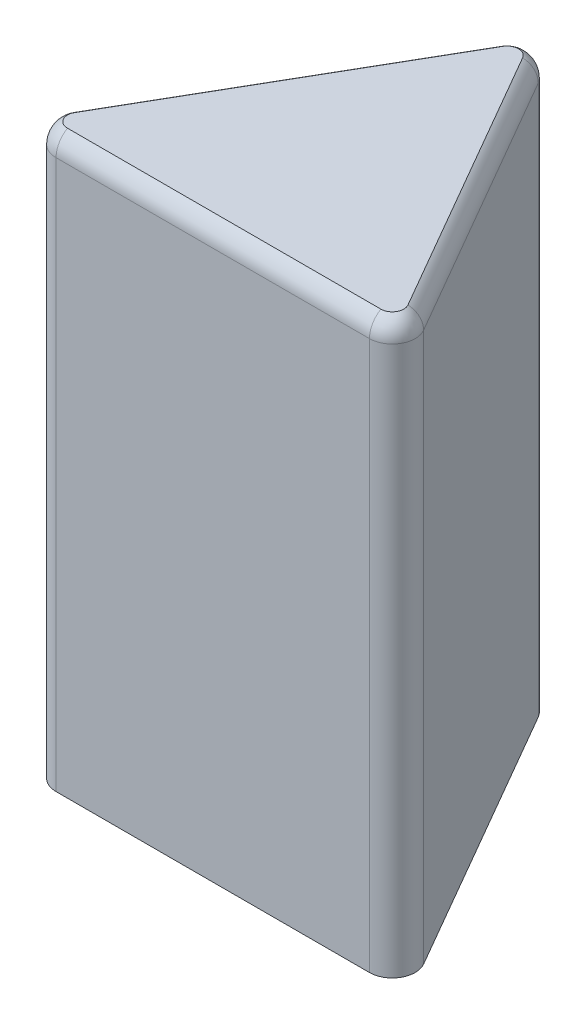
ISO-10303-21;
HEADER;
FILE_DESCRIPTION(('STEP AP214'),'2;1');
FILE_NAME('part.step','',(''),(''),'','','');
FILE_SCHEMA(('AUTOMOTIVE_DESIGN { 1 0 10303 214 1 1 1 1 }'));
ENDSEC;
DATA;
#1=APPLICATION_CONTEXT('core data for automotive mechanical design processes');
#2=APPLICATION_PROTOCOL_DEFINITION('international standard','automotive_design',2000,#1);
#3=PRODUCT_CONTEXT('',#1,'mechanical');
#4=PRODUCT('Part','Part','',(#3));
#5=PRODUCT_RELATED_PRODUCT_CATEGORY('part','',(#4));
#6=PRODUCT_DEFINITION_FORMATION('','',#4);
#7=PRODUCT_DEFINITION_CONTEXT('part definition',#1,'design');
#8=PRODUCT_DEFINITION('design','',#6,#7);
#9=PRODUCT_DEFINITION_SHAPE('','',#8);
#10=(LENGTH_UNIT() NAMED_UNIT(*) SI_UNIT(.MILLI.,.METRE.));
#11=(NAMED_UNIT(*) PLANE_ANGLE_UNIT() SI_UNIT($,.RADIAN.));
#12=(NAMED_UNIT(*) SI_UNIT($,.STERADIAN.) SOLID_ANGLE_UNIT());
#13=UNCERTAINTY_MEASURE_WITH_UNIT(LENGTH_MEASURE(1.E-05),#10,'distance_accuracy_value','');
#14=(GEOMETRIC_REPRESENTATION_CONTEXT(3) GLOBAL_UNCERTAINTY_ASSIGNED_CONTEXT((#13)) GLOBAL_UNIT_ASSIGNED_CONTEXT((#10,
#11,#12)) REPRESENTATION_CONTEXT('',''));
#15=CARTESIAN_POINT('',(0.,0.,0.));
#16=DIRECTION('',(0.,0.,1.));
#17=DIRECTION('',(1.,0.,0.));
#18=AXIS2_PLACEMENT_3D('',#15,#16,#17);
#19=CARTESIAN_POINT('',(0.,25.,0.));
#20=DIRECTION('',(0.,-1.,0.));
#21=DIRECTION('',(0.,0.,-1.));
#22=AXIS2_PLACEMENT_3D('',#19,#20,#21);
#23=CYLINDRICAL_SURFACE('',#22,4.05);
#24=DIRECTION('',(0.,-1.,0.));
#25=VECTOR('',#24,1.);
#26=CARTESIAN_POINT('',(-1.55,25.,-3.74165738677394));
#27=LINE('',#26,#25);
#28=CARTESIAN_POINT('',(-1.55,22.,-3.74165738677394));
#29=VERTEX_POINT('',#28);
#30=CARTESIAN_POINT('',(-1.55,0.5,-3.74165738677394));
#31=VERTEX_POINT('',#30);
#32=EDGE_CURVE('E181',#29,#31,#27,.T.);
#33=ORIENTED_EDGE('',*,*,#32,.F.);
#34=CARTESIAN_POINT('',(0.,22.,0.));
#35=DIRECTION('',(0.,1.,0.));
#36=DIRECTION('',(0.,0.,1.));
#37=AXIS2_PLACEMENT_3D('',#34,#35,#36);
#38=CIRCLE('',#37,4.05);
#39=CARTESIAN_POINT('',(1.55,22.,-3.74165738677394));
#40=VERTEX_POINT('',#39);
#41=EDGE_CURVE('E54',#29,#40,#38,.T.);
#42=ORIENTED_EDGE('',*,*,#41,.T.);
#43=DIRECTION('',(0.,-1.,0.));
#44=VECTOR('',#43,1.);
#45=CARTESIAN_POINT('',(1.55,25.,-3.74165738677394));
#46=LINE('',#45,#44);
#47=CARTESIAN_POINT('',(1.55,0.5,-3.74165738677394));
#48=VERTEX_POINT('',#47);
#49=EDGE_CURVE('E188',#40,#48,#46,.T.);
#50=ORIENTED_EDGE('',*,*,#49,.T.);
#51=CARTESIAN_POINT('',(0.,0.5,0.));
#52=DIRECTION('',(0.,1.,0.));
#53=DIRECTION('',(0.,0.,1.));
#54=AXIS2_PLACEMENT_3D('',#51,#52,#53);
#55=CIRCLE('',#54,4.05);
#56=EDGE_CURVE('E238',#48,#31,#55,.F.);
#57=ORIENTED_EDGE('',*,*,#56,.T.);
#58=EDGE_LOOP('',(#33,#42,#50,#57));
#59=FACE_BOUND('',#58,.T.);
#60=ADVANCED_FACE('F39',(#59),#23,.F.);
#61=CARTESIAN_POINT('',(1.55,25.,-5.15));
#62=DIRECTION('',(-1.,0.,0.));
#63=DIRECTION('',(0.,0.,1.));
#64=AXIS2_PLACEMENT_3D('',#61,#62,#63);
#65=PLANE('',#64);
#66=ORIENTED_EDGE('',*,*,#49,.F.);
#67=DIRECTION('',(0.,0.,-1.));
#68=VECTOR('',#67,1.);
#69=CARTESIAN_POINT('',(1.55,22.,-5.15));
#70=LINE('',#69,#68);
#71=CARTESIAN_POINT('',(1.55,22.,-5.15));
#72=VERTEX_POINT('',#71);
#73=EDGE_CURVE('E177',#40,#72,#70,.T.);
#74=ORIENTED_EDGE('',*,*,#73,.T.);
#75=DIRECTION('',(0.,-1.,0.));
#76=VECTOR('',#75,1.);
#77=CARTESIAN_POINT('',(1.55,25.,-5.15));
#78=LINE('',#77,#76);
#79=CARTESIAN_POINT('',(1.55,0.5,-5.15));
#80=VERTEX_POINT('',#79);
#81=EDGE_CURVE('E186',#72,#80,#78,.T.);
#82=ORIENTED_EDGE('',*,*,#81,.T.);
#83=DIRECTION('',(0.,0.,1.));
#84=VECTOR('',#83,1.);
#85=CARTESIAN_POINT('',(1.55,0.5,-3.74165738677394));
#86=LINE('',#85,#84);
#87=EDGE_CURVE('E229',#80,#48,#86,.T.);
#88=ORIENTED_EDGE('',*,*,#87,.T.);
#89=EDGE_LOOP('',(#66,#74,#82,#88));
#90=FACE_BOUND('',#89,.T.);
#91=ADVANCED_FACE('F359',(#90),#65,.T.);
#92=CARTESIAN_POINT('',(-1.55,25.,-5.15));
#93=DIRECTION('',(0.,0.,1.));
#94=DIRECTION('',(1.,0.,0.));
#95=AXIS2_PLACEMENT_3D('',#92,#93,#94);
#96=PLANE('',#95);
#97=ORIENTED_EDGE('',*,*,#81,.F.);
#98=DIRECTION('',(-1.,0.,0.));
#99=VECTOR('',#98,1.);
#100=CARTESIAN_POINT('',(-1.55,22.,-5.15));
#101=LINE('',#100,#99);
#102=CARTESIAN_POINT('',(-1.55,22.,-5.15));
#103=VERTEX_POINT('',#102);
#104=EDGE_CURVE('E174',#72,#103,#101,.T.);
#105=ORIENTED_EDGE('',*,*,#104,.T.);
#106=DIRECTION('',(0.,-1.,0.));
#107=VECTOR('',#106,1.);
#108=CARTESIAN_POINT('',(-1.55,25.,-5.15));
#109=LINE('',#108,#107);
#110=CARTESIAN_POINT('',(-1.55,0.5,-5.15));
#111=VERTEX_POINT('',#110);
#112=EDGE_CURVE('E183',#103,#111,#109,.T.);
#113=ORIENTED_EDGE('',*,*,#112,.T.);
#114=DIRECTION('',(1.,0.,0.));
#115=VECTOR('',#114,1.);
#116=CARTESIAN_POINT('',(1.55,0.500000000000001,-5.15));
#117=LINE('',#116,#115);
#118=EDGE_CURVE('E232',#111,#80,#117,.T.);
#119=ORIENTED_EDGE('',*,*,#118,.T.);
#120=EDGE_LOOP('',(#97,#105,#113,#119));
#121=FACE_BOUND('',#120,.T.);
#122=ADVANCED_FACE('F365',(#121),#96,.T.);
#123=CARTESIAN_POINT('',(-1.55,25.,-3.74165738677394));
#124=DIRECTION('',(1.,0.,0.));
#125=DIRECTION('',(0.,0.,-1.));
#126=AXIS2_PLACEMENT_3D('',#123,#124,#125);
#127=PLANE('',#126);
#128=ORIENTED_EDGE('',*,*,#112,.F.);
#129=DIRECTION('',(0.,0.,1.));
#130=VECTOR('',#129,1.);
#131=CARTESIAN_POINT('',(-1.55,22.,-3.74165738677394));
#132=LINE('',#131,#130);
#133=EDGE_CURVE('E11',#103,#29,#132,.T.);
#134=ORIENTED_EDGE('',*,*,#133,.T.);
#135=ORIENTED_EDGE('',*,*,#32,.T.);
#136=DIRECTION('',(0.,0.,-1.));
#137=VECTOR('',#136,1.);
#138=CARTESIAN_POINT('',(-1.55,0.500000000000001,-5.15));
#139=LINE('',#138,#137);
#140=EDGE_CURVE('E235',#31,#111,#139,.T.);
#141=ORIENTED_EDGE('',*,*,#140,.T.);
#142=EDGE_LOOP('',(#128,#134,#135,#141));
#143=FACE_BOUND('',#142,.T.);
#144=ADVANCED_FACE('F355',(#143),#127,.T.);
#145=CARTESIAN_POINT('',(-6.85,0.,3.95484934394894));
#146=DIRECTION('',(0.,1.,0.));
#147=DIRECTION('',(0.,0.,1.));
#148=AXIS2_PLACEMENT_3D('',#145,#146,#147);
#149=PLANE('',#148);
#150=CARTESIAN_POINT('',(0.,0.,0.));
#151=DIRECTION('',(0.,1.,0.));
#152=DIRECTION('',(0.,0.,1.));
#153=AXIS2_PLACEMENT_3D('',#150,#151,#152);
#154=CIRCLE('',#153,4.55);
#155=CARTESIAN_POINT('',(-2.04999999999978,0.,-4.06201920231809));
#156=VERTEX_POINT('',#155);
#157=CARTESIAN_POINT('',(2.04999999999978,0.,-4.06201920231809));
#158=VERTEX_POINT('',#157);
#159=EDGE_CURVE('E220',#156,#158,#154,.T.);
#160=ORIENTED_EDGE('',*,*,#159,.T.);
#161=DIRECTION('',(0.,0.,-1.));
#162=VECTOR('',#161,1.);
#163=CARTESIAN_POINT('',(2.05,0.,-5.15));
#164=LINE('',#163,#162);
#165=CARTESIAN_POINT('',(2.05,0.,-5.65));
#166=VERTEX_POINT('',#165);
#167=EDGE_CURVE('E226',#158,#166,#164,.T.);
#168=ORIENTED_EDGE('',*,*,#167,.T.);
#169=DIRECTION('',(-1.,0.,0.));
#170=VECTOR('',#169,1.);
#171=CARTESIAN_POINT('',(-1.55,0.,-5.65));
#172=LINE('',#171,#170);
#173=CARTESIAN_POINT('',(-2.05,0.,-5.65));
#174=VERTEX_POINT('',#173);
#175=EDGE_CURVE('E224',#166,#174,#172,.T.);
#176=ORIENTED_EDGE('',*,*,#175,.T.);
#177=DIRECTION('',(0.,0.,1.));
#178=VECTOR('',#177,1.);
#179=CARTESIAN_POINT('',(-2.05,0.,-3.74165738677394));
#180=LINE('',#179,#178);
#181=EDGE_CURVE('E222',#174,#156,#180,.T.);
#182=ORIENTED_EDGE('',*,*,#181,.T.);
#183=EDGE_LOOP('',(#160,#168,#176,#182));
#184=FACE_BOUND('',#183,.T.);
#185=CARTESIAN_POINT('',(-6.85,0.,3.95484934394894));
#186=DIRECTION('',(0.,1.,0.));
#187=DIRECTION('',(0.,0.,1.));
#188=AXIS2_PLACEMENT_3D('',#185,#186,#187);
#189=CIRCLE('',#188,1.);
#190=CARTESIAN_POINT('',(-7.71602540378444,0.,3.45484934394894));
#191=VERTEX_POINT('',#190);
#192=CARTESIAN_POINT('',(-6.85,0.,4.95484934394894));
#193=VERTEX_POINT('',#192);
#194=EDGE_CURVE('E190',#191,#193,#189,.T.);
#195=ORIENTED_EDGE('',*,*,#194,.F.);
#196=DIRECTION('',(-0.5,0.,0.866025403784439));
#197=VECTOR('',#196,1.);
#198=CARTESIAN_POINT('',(-0.866025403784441,0.,-8.40969868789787));
#199=LINE('',#198,#197);
#200=CARTESIAN_POINT('',(-0.866025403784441,0.,-8.40969868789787));
#201=VERTEX_POINT('',#200);
#202=EDGE_CURVE('E205',#201,#191,#199,.T.);
#203=ORIENTED_EDGE('',*,*,#202,.F.);
#204=CARTESIAN_POINT('',(0.,0.,-7.90969868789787));
#205=DIRECTION('',(0.,1.,0.));
#206=DIRECTION('',(0.,0.,1.));
#207=AXIS2_PLACEMENT_3D('',#204,#205,#206);
#208=CIRCLE('',#207,1.);
#209=CARTESIAN_POINT('',(0.866025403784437,0.,-8.40969868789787));
#210=VERTEX_POINT('',#209);
#211=EDGE_CURVE('E202',#210,#201,#208,.T.);
#212=ORIENTED_EDGE('',*,*,#211,.F.);
#213=DIRECTION('',(-0.5,0.,-0.866025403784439));
#214=VECTOR('',#213,1.);
#215=CARTESIAN_POINT('',(0.866025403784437,0.,-8.40969868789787));
#216=LINE('',#215,#214);
#217=CARTESIAN_POINT('',(7.71602540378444,0.,3.45484934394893));
#218=VERTEX_POINT('',#217);
#219=EDGE_CURVE('E199',#218,#210,#216,.T.);
#220=ORIENTED_EDGE('',*,*,#219,.F.);
#221=CARTESIAN_POINT('',(6.85,0.,3.95484934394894));
#222=DIRECTION('',(0.,1.,0.));
#223=DIRECTION('',(0.,0.,1.));
#224=AXIS2_PLACEMENT_3D('',#221,#222,#223);
#225=CIRCLE('',#224,0.999999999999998);
#226=CARTESIAN_POINT('',(6.85,0.,4.95484934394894));
#227=VERTEX_POINT('',#226);
#228=EDGE_CURVE('E196',#227,#218,#225,.T.);
#229=ORIENTED_EDGE('',*,*,#228,.F.);
#230=DIRECTION('',(1.,0.,0.));
#231=VECTOR('',#230,1.);
#232=CARTESIAN_POINT('',(-6.85,0.,4.95484934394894));
#233=LINE('',#232,#231);
#234=EDGE_CURVE('E193',#193,#227,#233,.T.);
#235=ORIENTED_EDGE('',*,*,#234,.F.);
#236=EDGE_LOOP('',(#195,#203,#212,#220,#229,#235));
#237=FACE_BOUND('',#236,.T.);
#238=ADVANCED_FACE('F340',(#184,#237),#149,.F.);
#239=CARTESIAN_POINT('',(-6.85,25.,3.95484934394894));
#240=DIRECTION('',(0.,-1.,0.));
#241=DIRECTION('',(0.,0.,-1.));
#242=AXIS2_PLACEMENT_3D('',#239,#240,#241);
#243=CYLINDRICAL_SURFACE('',#242,1.);
#244=DIRECTION('',(0.,-1.,0.));
#245=VECTOR('',#244,1.);
#246=CARTESIAN_POINT('',(-6.85,25.,4.95484934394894));
#247=LINE('',#246,#245);
#248=CARTESIAN_POINT('',(-6.85,24.,4.95484934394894));
#249=VERTEX_POINT('',#248);
#250=EDGE_CURVE('E218',#249,#193,#247,.T.);
#251=ORIENTED_EDGE('',*,*,#250,.F.);
#252=CARTESIAN_POINT('',(-6.85,24.,3.95484934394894));
#253=DIRECTION('',(0.,-1.,0.));
#254=DIRECTION('',(0.,0.,-1.));
#255=AXIS2_PLACEMENT_3D('',#252,#253,#254);
#256=CIRCLE('',#255,1.);
#257=CARTESIAN_POINT('',(-7.71602540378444,24.,3.45484934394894));
#258=VERTEX_POINT('',#257);
#259=EDGE_CURVE('E157',#249,#258,#256,.T.);
#260=ORIENTED_EDGE('',*,*,#259,.T.);
#261=DIRECTION('',(0.,-1.,0.));
#262=VECTOR('',#261,1.);
#263=CARTESIAN_POINT('',(-7.71602540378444,25.,3.45484934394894));
#264=LINE('',#263,#262);
#265=EDGE_CURVE('E208',#258,#191,#264,.T.);
#266=ORIENTED_EDGE('',*,*,#265,.T.);
#267=ORIENTED_EDGE('',*,*,#194,.T.);
#268=EDGE_LOOP('',(#251,#260,#266,#267));
#269=FACE_BOUND('',#268,.T.);
#270=ADVANCED_FACE('F348',(#269),#243,.T.);
#271=CARTESIAN_POINT('',(-6.85,25.,4.95484934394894));
#272=DIRECTION('',(0.,0.,-1.));
#273=DIRECTION('',(-1.,0.,0.));
#274=AXIS2_PLACEMENT_3D('',#271,#272,#273);
#275=PLANE('',#274);
#276=DIRECTION('',(0.,-1.,0.));
#277=VECTOR('',#276,1.);
#278=CARTESIAN_POINT('',(6.85,25.,4.95484934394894));
#279=LINE('',#278,#277);
#280=CARTESIAN_POINT('',(6.85,24.,4.95484934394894));
#281=VERTEX_POINT('',#280);
#282=EDGE_CURVE('E216',#281,#227,#279,.T.);
#283=ORIENTED_EDGE('',*,*,#282,.F.);
#284=DIRECTION('',(1.,0.,0.));
#285=VECTOR('',#284,1.);
#286=CARTESIAN_POINT('',(-6.85,24.,4.95484934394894));
#287=LINE('',#286,#285);
#288=EDGE_CURVE('E151',#281,#249,#287,.F.);
#289=ORIENTED_EDGE('',*,*,#288,.T.);
#290=ORIENTED_EDGE('',*,*,#250,.T.);
#291=ORIENTED_EDGE('',*,*,#234,.T.);
#292=EDGE_LOOP('',(#283,#289,#290,#291));
#293=FACE_BOUND('',#292,.T.);
#294=ADVANCED_FACE('F334',(#293),#275,.F.);
#295=CARTESIAN_POINT('',(6.85,25.,3.95484934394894));
#296=DIRECTION('',(0.,-1.,0.));
#297=DIRECTION('',(0.,0.,-1.));
#298=AXIS2_PLACEMENT_3D('',#295,#296,#297);
#299=CYLINDRICAL_SURFACE('',#298,0.999999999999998);
#300=DIRECTION('',(0.,-1.,0.));
#301=VECTOR('',#300,1.);
#302=CARTESIAN_POINT('',(7.71602540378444,25.,3.45484934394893));
#303=LINE('',#302,#301);
#304=CARTESIAN_POINT('',(7.71602540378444,24.,3.45484934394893));
#305=VERTEX_POINT('',#304);
#306=EDGE_CURVE('E214',#305,#218,#303,.T.);
#307=ORIENTED_EDGE('',*,*,#306,.F.);
#308=CARTESIAN_POINT('',(6.85,24.,3.95484934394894));
#309=DIRECTION('',(0.,-1.,0.));
#310=DIRECTION('',(0.,0.,-1.));
#311=AXIS2_PLACEMENT_3D('',#308,#309,#310);
#312=CIRCLE('',#311,0.999999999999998);
#313=EDGE_CURVE('E299',#305,#281,#312,.T.);
#314=ORIENTED_EDGE('',*,*,#313,.T.);
#315=ORIENTED_EDGE('',*,*,#282,.T.);
#316=ORIENTED_EDGE('',*,*,#228,.T.);
#317=EDGE_LOOP('',(#307,#314,#315,#316));
#318=FACE_BOUND('',#317,.T.);
#319=ADVANCED_FACE('F332',(#318),#299,.T.);
#320=CARTESIAN_POINT('',(0.866025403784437,25.,-8.40969868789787));
#321=DIRECTION('',(-0.866025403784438,0.,0.5));
#322=DIRECTION('',(0.5,0.,0.866025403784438));
#323=AXIS2_PLACEMENT_3D('',#320,#321,#322);
#324=PLANE('',#323);
#325=DIRECTION('',(0.,-1.,0.));
#326=VECTOR('',#325,1.);
#327=CARTESIAN_POINT('',(0.866025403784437,25.,-8.40969868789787));
#328=LINE('',#327,#326);
#329=CARTESIAN_POINT('',(0.866025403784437,24.,-8.40969868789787));
#330=VERTEX_POINT('',#329);
#331=EDGE_CURVE('E212',#330,#210,#328,.T.);
#332=ORIENTED_EDGE('',*,*,#331,.F.);
#333=DIRECTION('',(-0.5,0.,-0.866025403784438));
#334=VECTOR('',#333,1.);
#335=CARTESIAN_POINT('',(7.71602540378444,24.,3.45484934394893));
#336=LINE('',#335,#334);
#337=EDGE_CURVE('E297',#330,#305,#336,.F.);
#338=ORIENTED_EDGE('',*,*,#337,.T.);
#339=ORIENTED_EDGE('',*,*,#306,.T.);
#340=ORIENTED_EDGE('',*,*,#219,.T.);
#341=EDGE_LOOP('',(#332,#338,#339,#340));
#342=FACE_BOUND('',#341,.T.);
#343=ADVANCED_FACE('F322',(#342),#324,.F.);
#344=CARTESIAN_POINT('',(0.,25.,-7.90969868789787));
#345=DIRECTION('',(0.,-1.,0.));
#346=DIRECTION('',(0.,0.,-1.));
#347=AXIS2_PLACEMENT_3D('',#344,#345,#346);
#348=CYLINDRICAL_SURFACE('',#347,1.);
#349=DIRECTION('',(0.,-1.,0.));
#350=VECTOR('',#349,1.);
#351=CARTESIAN_POINT('',(-0.866025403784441,25.,-8.40969868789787));
#352=LINE('',#351,#350);
#353=CARTESIAN_POINT('',(-0.866025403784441,24.,-8.40969868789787));
#354=VERTEX_POINT('',#353);
#355=EDGE_CURVE('E210',#354,#201,#352,.T.);
#356=ORIENTED_EDGE('',*,*,#355,.F.);
#357=CARTESIAN_POINT('',(0.,24.,-7.90969868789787));
#358=DIRECTION('',(0.,-1.,0.));
#359=DIRECTION('',(0.,0.,-1.));
#360=AXIS2_PLACEMENT_3D('',#357,#358,#359);
#361=CIRCLE('',#360,1.);
#362=EDGE_CURVE('E294',#354,#330,#361,.T.);
#363=ORIENTED_EDGE('',*,*,#362,.T.);
#364=ORIENTED_EDGE('',*,*,#331,.T.);
#365=ORIENTED_EDGE('',*,*,#211,.T.);
#366=EDGE_LOOP('',(#356,#363,#364,#365));
#367=FACE_BOUND('',#366,.T.);
#368=ADVANCED_FACE('F320',(#367),#348,.T.);
#369=CARTESIAN_POINT('',(-0.866025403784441,25.,-8.40969868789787));
#370=DIRECTION('',(0.866025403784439,0.,0.5));
#371=DIRECTION('',(0.5,0.,-0.866025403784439));
#372=AXIS2_PLACEMENT_3D('',#369,#370,#371);
#373=PLANE('',#372);
#374=ORIENTED_EDGE('',*,*,#265,.F.);
#375=DIRECTION('',(-0.5,0.,0.866025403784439));
#376=VECTOR('',#375,1.);
#377=CARTESIAN_POINT('',(-0.866025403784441,24.,-8.40969868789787));
#378=LINE('',#377,#376);
#379=EDGE_CURVE('E291',#258,#354,#378,.F.);
#380=ORIENTED_EDGE('',*,*,#379,.T.);
#381=ORIENTED_EDGE('',*,*,#355,.T.);
#382=ORIENTED_EDGE('',*,*,#202,.T.);
#383=EDGE_LOOP('',(#374,#380,#381,#382));
#384=FACE_BOUND('',#383,.T.);
#385=ADVANCED_FACE('F281',(#384),#373,.F.);
#386=CARTESIAN_POINT('',(-2.05,0.,3.95484934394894));
#387=DIRECTION('',(0.707106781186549,-0.707106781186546,0.));
#388=DIRECTION('',(0.,0.,-1.));
#389=AXIS2_PLACEMENT_3D('',#386,#387,#388);
#390=PLANE('',#389);
#391=DIRECTION('',(0.577350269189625,0.577350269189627,0.577350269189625));
#392=VECTOR('',#391,1.);
#393=CARTESIAN_POINT('',(-3.65,-1.6,-7.24999999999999));
#394=LINE('',#393,#392);
#395=EDGE_CURVE('E253',#111,#174,#394,.F.);
#396=ORIENTED_EDGE('',*,*,#395,.F.);
#397=ORIENTED_EDGE('',*,*,#140,.F.);
#398=CARTESIAN_POINT('',(-2.05,0.,-4.06201920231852));
#399=CARTESIAN_POINT('',(-2.00805370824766,0.041946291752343,-4.03620271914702));
#400=CARTESIAN_POINT('',(-1.96617081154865,0.0838291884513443,-4.01017978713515));
#401=CARTESIAN_POINT('',(-1.88254348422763,0.167456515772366,-3.95770217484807));
#402=CARTESIAN_POINT('',(-1.84079904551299,0.209200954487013,-3.93124752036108));
#403=CARTESIAN_POINT('',(-1.75745496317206,0.292545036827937,-3.87788431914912));
#404=CARTESIAN_POINT('',(-1.71585532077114,0.334144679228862,-3.85097576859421));
#405=CARTESIAN_POINT('',(-1.63280936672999,0.417190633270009,-3.79668053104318));
#406=CARTESIAN_POINT('',(-1.59136306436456,0.458636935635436,-3.76929381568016));
#407=CARTESIAN_POINT('',(-1.55,0.500000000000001,-3.74165738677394));
#408=B_SPLINE_CURVE_WITH_KNOTS('',3,(#398,#399,#400,#401,#402,#403,#404,#405,#406,#407),
.UNSPECIFIED.,.F.,.F.,(4,2,2,2,4),(0.,0.19408557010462,0.388159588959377,0.582235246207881,
0.776322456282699),.UNSPECIFIED.);
#409=EDGE_CURVE('E184',#156,#31,#408,.T.);
#410=ORIENTED_EDGE('',*,*,#409,.F.);
#411=ORIENTED_EDGE('',*,*,#181,.F.);
#412=EDGE_LOOP('',(#396,#397,#410,#411));
#413=FACE_BOUND('',#412,.T.);
#414=ADVANCED_FACE('F275',(#413),#390,.T.);
#415=CARTESIAN_POINT('',(0.,0.,0.));
#416=DIRECTION('',(0.,-1.,0.));
#417=DIRECTION('',(0.,0.,-1.));
#418=AXIS2_PLACEMENT_3D('',#415,#416,#417);
#419=CONICAL_SURFACE('',#418,4.55,0.785398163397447);
#420=ORIENTED_EDGE('',*,*,#409,.T.);
#421=ORIENTED_EDGE('',*,*,#56,.F.);
#422=CARTESIAN_POINT('',(1.55,0.5,-3.74165738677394));
#423=CARTESIAN_POINT('',(1.59136306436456,0.458636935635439,-3.76929381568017));
#424=CARTESIAN_POINT('',(1.63280936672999,0.41719063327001,-3.79668053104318));
#425=CARTESIAN_POINT('',(1.71585532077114,0.334144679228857,-3.85097576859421));
#426=CARTESIAN_POINT('',(1.75745496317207,0.29254503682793,-3.8778843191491));
#427=CARTESIAN_POINT('',(1.84079904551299,0.209200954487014,-3.9312475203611));
#428=CARTESIAN_POINT('',(1.88254348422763,0.167456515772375,-3.95770217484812));
#429=CARTESIAN_POINT('',(1.96617081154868,0.083829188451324,-4.01017978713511));
#430=CARTESIAN_POINT('',(2.00805370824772,0.0419462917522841,-4.03620271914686));
#431=CARTESIAN_POINT('',(2.05000000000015,-1.51155966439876E-13,-4.06201920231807));
#432=B_SPLINE_CURVE_WITH_KNOTS('',3,(#422,#423,#424,#425,#426,#427,#428,#429,#430,#431),
.UNSPECIFIED.,.F.,.F.,(4,2,2,2,4),(0.,0.194087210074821,0.388162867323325,0.582236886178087,
0.776322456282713),.UNSPECIFIED.);
#433=EDGE_CURVE('E243',#158,#48,#432,.F.);
#434=ORIENTED_EDGE('',*,*,#433,.F.);
#435=ORIENTED_EDGE('',*,*,#159,.F.);
#436=EDGE_LOOP('',(#420,#421,#434,#435));
#437=FACE_BOUND('',#436,.T.);
#438=ADVANCED_FACE('F256',(#437),#419,.F.);
#439=CARTESIAN_POINT('',(-6.85,0.,-5.65));
#440=DIRECTION('',(0.,-0.707106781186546,0.707106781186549));
#441=DIRECTION('',(1.,0.,0.));
#442=AXIS2_PLACEMENT_3D('',#439,#440,#441);
#443=PLANE('',#442);
#444=ORIENTED_EDGE('',*,*,#395,.T.);
#445=ORIENTED_EDGE('',*,*,#175,.F.);
#446=DIRECTION('',(-0.577350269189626,0.577350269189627,0.577350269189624));
#447=VECTOR('',#446,1.);
#448=CARTESIAN_POINT('',(-1.15161644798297,3.20161644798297,-2.44838355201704));
#449=LINE('',#448,#447);
#450=EDGE_CURVE('E241',#80,#166,#449,.F.);
#451=ORIENTED_EDGE('',*,*,#450,.F.);
#452=ORIENTED_EDGE('',*,*,#118,.F.);
#453=EDGE_LOOP('',(#444,#445,#451,#452));
#454=FACE_BOUND('',#453,.T.);
#455=ADVANCED_FACE('F267',(#454),#443,.T.);
#456=CARTESIAN_POINT('',(2.05,0.,3.95484934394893));
#457=DIRECTION('',(-0.707106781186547,-0.707106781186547,0.));
#458=DIRECTION('',(0.,0.,1.));
#459=AXIS2_PLACEMENT_3D('',#456,#457,#458);
#460=PLANE('',#459);
#461=ORIENTED_EDGE('',*,*,#433,.T.);
#462=ORIENTED_EDGE('',*,*,#87,.F.);
#463=ORIENTED_EDGE('',*,*,#450,.T.);
#464=ORIENTED_EDGE('',*,*,#167,.F.);
#465=EDGE_LOOP('',(#461,#462,#463,#464));
#466=FACE_BOUND('',#465,.T.);
#467=ADVANCED_FACE('F260',(#466),#460,.T.);
#468=CARTESIAN_POINT('',(3.425,24.,-1.97742467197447));
#469=DIRECTION('',(0.5,0.,0.866025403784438));
#470=DIRECTION('',(0.866025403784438,0.,-0.5));
#471=AXIS2_PLACEMENT_3D('',#468,#469,#470);
#472=CYLINDRICAL_SURFACE('',#471,1.);
#473=DIRECTION('',(0.5,0.,0.866025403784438));
#474=VECTOR('',#473,1.);
#475=CARTESIAN_POINT('',(3.85801270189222,24.8660254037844,-2.22742467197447));
#476=LINE('',#475,#474);
#477=CARTESIAN_POINT('',(7.28301270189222,24.8660254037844,3.70484934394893));
#478=VERTEX_POINT('',#477);
#479=CARTESIAN_POINT('',(0.433012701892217,24.8660254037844,-8.15969868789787));
#480=VERTEX_POINT('',#479);
#481=EDGE_CURVE('E172',#478,#480,#476,.F.);
#482=ORIENTED_EDGE('',*,*,#481,.F.);
#483=CARTESIAN_POINT('',(6.85,24.,3.95484934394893));
#484=DIRECTION('',(0.500000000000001,0.,0.866025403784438));
#485=DIRECTION('',(0.866025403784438,0.,-0.500000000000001));
#486=AXIS2_PLACEMENT_3D('',#483,#484,#485);
#487=CIRCLE('',#486,1.);
#488=EDGE_CURVE('E306',#305,#478,#487,.T.);
#489=ORIENTED_EDGE('',*,*,#488,.F.);
#490=ORIENTED_EDGE('',*,*,#337,.F.);
#491=CARTESIAN_POINT('',(0.,24.,-7.90969868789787));
#492=DIRECTION('',(-0.499999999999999,0.,-0.866025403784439));
#493=DIRECTION('',(-0.866025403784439,0.,0.499999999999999));
#494=AXIS2_PLACEMENT_3D('',#491,#492,#493);
#495=CIRCLE('',#494,1.);
#496=EDGE_CURVE('E244',#480,#330,#495,.T.);
#497=ORIENTED_EDGE('',*,*,#496,.F.);
#498=EDGE_LOOP('',(#482,#489,#490,#497));
#499=FACE_BOUND('',#498,.T.);
#500=ADVANCED_FACE('F41',(#499),#472,.T.);
#501=CARTESIAN_POINT('',(0.,24.,-7.90969868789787));
#502=DIRECTION('',(0.,1.,0.));
#503=DIRECTION('',(0.,0.,1.));
#504=AXIS2_PLACEMENT_3D('',#501,#502,#503);
#505=SPHERICAL_SURFACE('',#504,1.);
#506=CARTESIAN_POINT('',(0.,24.8660254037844,-7.90969868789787));
#507=DIRECTION('',(0.,-1.,0.));
#508=DIRECTION('',(0.,0.,-1.));
#509=AXIS2_PLACEMENT_3D('',#506,#507,#508);
#510=CIRCLE('',#509,0.499999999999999);
#511=CARTESIAN_POINT('',(-0.433012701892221,24.8660254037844,-8.15969868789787));
#512=VERTEX_POINT('',#511);
#513=EDGE_CURVE('E170',#480,#512,#510,.F.);
#514=ORIENTED_EDGE('',*,*,#513,.F.);
#515=ORIENTED_EDGE('',*,*,#496,.T.);
#516=ORIENTED_EDGE('',*,*,#362,.F.);
#517=CARTESIAN_POINT('',(0.,24.,-7.90969868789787));
#518=DIRECTION('',(-0.499999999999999,0.,0.866025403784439));
#519=DIRECTION('',(0.866025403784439,0.,0.499999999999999));
#520=AXIS2_PLACEMENT_3D('',#517,#518,#519);
#521=CIRCLE('',#520,1.);
#522=EDGE_CURVE('E304',#512,#354,#521,.T.);
#523=ORIENTED_EDGE('',*,*,#522,.F.);
#524=EDGE_LOOP('',(#514,#515,#516,#523));
#525=FACE_BOUND('',#524,.T.);
#526=ADVANCED_FACE('F313',(#525),#505,.T.);
#527=CARTESIAN_POINT('',(6.85,24.,3.95484934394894));
#528=DIRECTION('',(0.,1.,0.));
#529=DIRECTION('',(0.,0.,1.));
#530=AXIS2_PLACEMENT_3D('',#527,#528,#529);
#531=SPHERICAL_SURFACE('',#530,1.);
#532=CARTESIAN_POINT('',(6.85,24.8660254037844,3.95484934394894));
#533=DIRECTION('',(0.,-1.,0.));
#534=DIRECTION('',(0.,0.,-1.));
#535=AXIS2_PLACEMENT_3D('',#532,#533,#534);
#536=CIRCLE('',#535,0.5);
#537=CARTESIAN_POINT('',(6.85,24.8660254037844,4.45484934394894));
#538=VERTEX_POINT('',#537);
#539=EDGE_CURVE('E61',#538,#478,#536,.F.);
#540=ORIENTED_EDGE('',*,*,#539,.F.);
#541=CARTESIAN_POINT('',(6.85,24.,3.95484934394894));
#542=DIRECTION('',(-1.,0.,0.));
#543=DIRECTION('',(0.,0.,1.));
#544=AXIS2_PLACEMENT_3D('',#541,#542,#543);
#545=CIRCLE('',#544,1.);
#546=EDGE_CURVE('E165',#281,#538,#545,.T.);
#547=ORIENTED_EDGE('',*,*,#546,.F.);
#548=ORIENTED_EDGE('',*,*,#313,.F.);
#549=ORIENTED_EDGE('',*,*,#488,.T.);
#550=EDGE_LOOP('',(#540,#547,#548,#549));
#551=FACE_BOUND('',#550,.T.);
#552=ADVANCED_FACE('F329',(#551),#531,.T.);
#553=CARTESIAN_POINT('',(-6.85,24.,3.95484934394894));
#554=DIRECTION('',(0.5,0.,-0.866025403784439));
#555=DIRECTION('',(-0.866025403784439,0.,-0.5));
#556=AXIS2_PLACEMENT_3D('',#553,#554,#555);
#557=CYLINDRICAL_SURFACE('',#556,1.);
#558=DIRECTION('',(0.5,0.,-0.866025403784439));
#559=VECTOR('',#558,1.);
#560=CARTESIAN_POINT('',(-7.28301270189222,24.8660254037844,3.70484934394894));
#561=LINE('',#560,#559);
#562=CARTESIAN_POINT('',(-7.28301270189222,24.8660254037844,3.70484934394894));
#563=VERTEX_POINT('',#562);
#564=EDGE_CURVE('E148',#512,#563,#561,.F.);
#565=ORIENTED_EDGE('',*,*,#564,.F.);
#566=ORIENTED_EDGE('',*,*,#522,.T.);
#567=ORIENTED_EDGE('',*,*,#379,.F.);
#568=CARTESIAN_POINT('',(-6.85,24.,3.95484934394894));
#569=DIRECTION('',(-0.499999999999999,0.,0.866025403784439));
#570=DIRECTION('',(0.866025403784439,0.,0.499999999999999));
#571=AXIS2_PLACEMENT_3D('',#568,#569,#570);
#572=CIRCLE('',#571,1.);
#573=EDGE_CURVE('E160',#563,#258,#572,.T.);
#574=ORIENTED_EDGE('',*,*,#573,.F.);
#575=EDGE_LOOP('',(#565,#566,#567,#574));
#576=FACE_BOUND('',#575,.T.);
#577=ADVANCED_FACE('F346',(#576),#557,.T.);
#578=CARTESIAN_POINT('',(-6.85,24.,3.95484934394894));
#579=DIRECTION('',(-1.,0.,0.));
#580=DIRECTION('',(0.,0.,1.));
#581=AXIS2_PLACEMENT_3D('',#578,#579,#580);
#582=CYLINDRICAL_SURFACE('',#581,1.);
#583=DIRECTION('',(-1.,0.,0.));
#584=VECTOR('',#583,1.);
#585=CARTESIAN_POINT('',(-6.85,24.8660254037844,4.45484934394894));
#586=LINE('',#585,#584);
#587=CARTESIAN_POINT('',(-6.85,24.8660254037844,4.45484934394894));
#588=VERTEX_POINT('',#587);
#589=EDGE_CURVE('E146',#588,#538,#586,.F.);
#590=ORIENTED_EDGE('',*,*,#589,.F.);
#591=CARTESIAN_POINT('',(-6.85,24.,3.95484934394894));
#592=DIRECTION('',(-1.,0.,0.));
#593=DIRECTION('',(0.,0.,1.));
#594=AXIS2_PLACEMENT_3D('',#591,#592,#593);
#595=CIRCLE('',#594,1.);
#596=EDGE_CURVE('E154',#249,#588,#595,.T.);
#597=ORIENTED_EDGE('',*,*,#596,.F.);
#598=ORIENTED_EDGE('',*,*,#288,.F.);
#599=ORIENTED_EDGE('',*,*,#546,.T.);
#600=EDGE_LOOP('',(#590,#597,#598,#599));
#601=FACE_BOUND('',#600,.T.);
#602=ADVANCED_FACE('F163',(#601),#582,.T.);
#603=CARTESIAN_POINT('',(-6.85,24.,3.95484934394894));
#604=DIRECTION('',(0.,1.,0.));
#605=DIRECTION('',(0.,0.,1.));
#606=AXIS2_PLACEMENT_3D('',#603,#604,#605);
#607=SPHERICAL_SURFACE('',#606,1.);
#608=CARTESIAN_POINT('',(-6.85,24.8660254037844,3.95484934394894));
#609=DIRECTION('',(0.,-1.,0.));
#610=DIRECTION('',(0.,0.,-1.));
#611=AXIS2_PLACEMENT_3D('',#608,#609,#610);
#612=CIRCLE('',#611,0.5);
#613=EDGE_CURVE('E47',#563,#588,#612,.F.);
#614=ORIENTED_EDGE('',*,*,#613,.F.);
#615=ORIENTED_EDGE('',*,*,#573,.T.);
#616=ORIENTED_EDGE('',*,*,#259,.F.);
#617=ORIENTED_EDGE('',*,*,#596,.T.);
#618=EDGE_LOOP('',(#614,#615,#616,#617));
#619=FACE_BOUND('',#618,.T.);
#620=ADVANCED_FACE('F155',(#619),#607,.T.);
#621=CARTESIAN_POINT('',(-6.85,22.,3.95484934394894));
#622=DIRECTION('',(0.,1.,0.));
#623=DIRECTION('',(0.,0.,1.));
#624=AXIS2_PLACEMENT_3D('',#621,#622,#623);
#625=PLANE('',#624);
#626=ORIENTED_EDGE('',*,*,#41,.F.);
#627=ORIENTED_EDGE('',*,*,#133,.F.);
#628=ORIENTED_EDGE('',*,*,#104,.F.);
#629=ORIENTED_EDGE('',*,*,#73,.F.);
#630=EDGE_LOOP('',(#626,#627,#628,#629));
#631=FACE_BOUND('',#630,.T.);
#632=ADVANCED_FACE('F447',(#631),#625,.F.);
#633=CARTESIAN_POINT('',(-6.85,24.8660254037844,3.95484934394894));
#634=DIRECTION('',(0.,1.,0.));
#635=DIRECTION('',(0.,0.,1.));
#636=AXIS2_PLACEMENT_3D('',#633,#634,#635);
#637=PLANE('',#636);
#638=ORIENTED_EDGE('',*,*,#613,.T.);
#639=ORIENTED_EDGE('',*,*,#589,.T.);
#640=ORIENTED_EDGE('',*,*,#539,.T.);
#641=ORIENTED_EDGE('',*,*,#481,.T.);
#642=ORIENTED_EDGE('',*,*,#513,.T.);
#643=ORIENTED_EDGE('',*,*,#564,.T.);
#644=EDGE_LOOP('',(#638,#639,#640,#641,#642,#643));
#645=FACE_BOUND('',#644,.T.);
#646=ADVANCED_FACE('F144',(#645),#637,.T.);
#647=CLOSED_SHELL('',(#60,#91,#122,#144,#238,#270,#294,#319,#343,#368,#385,#414,#438,#455,#467,
#500,#526,#552,#577,#602,#620,#632,#646));
#648=MANIFOLD_SOLID_BREP('B2',#647);
#649=ADVANCED_BREP_SHAPE_REPRESENTATION('',(#18,#648),#14);
#650=SHAPE_DEFINITION_REPRESENTATION(#9,#649);
ENDSEC;
END-ISO-10303-21;
